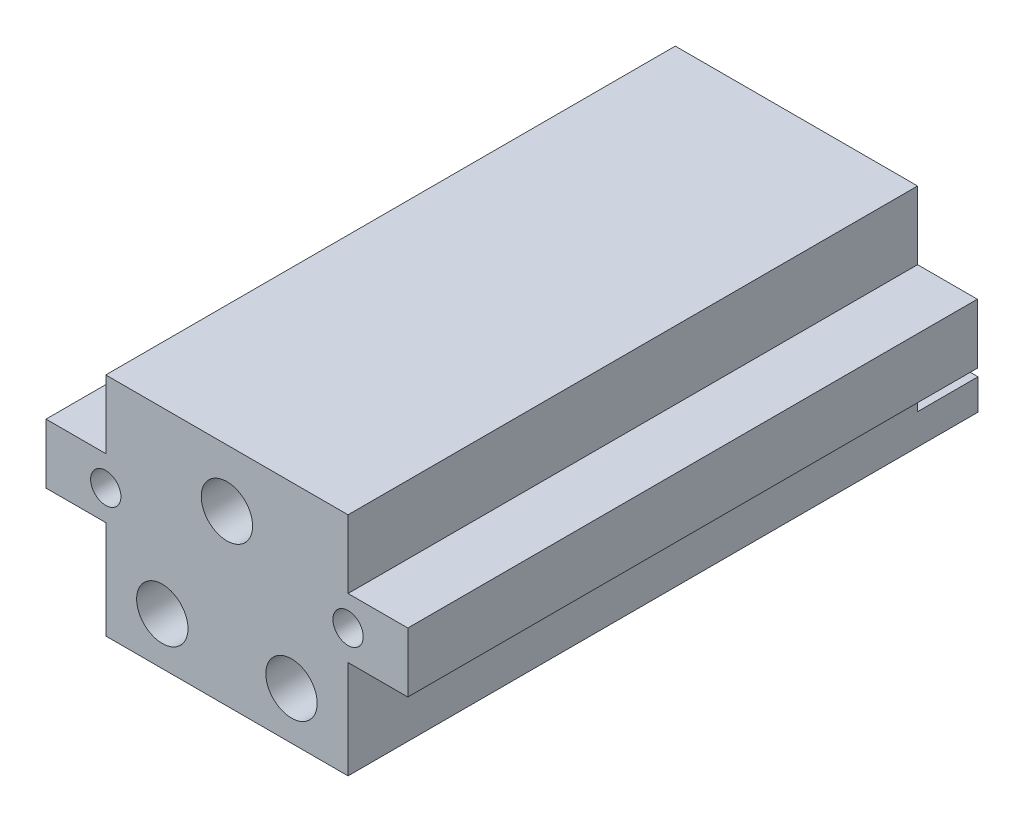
from build123d import *

# Parameters (mm, degrees)
EXTRUDE1_DEPTH                      = 24.765
EXTRUDE1_DEPTH_BACK                 = 24.765
SKETCH2_W                           = 28.448
SKETCH2_H                           = 4.7498
CUT_EXTRUDE1_DEPTH                  = 15.367
F_1_4_28_TAPPED_HOLE1_D             = 5.4102
F_1_4_28_TAPPED_HOLE1_DEPTH         = 6.35
F_1_4_28_TAPPED_HOLE1_TIP           = 1.625388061
F_1_4_0_25_DIAMETER_HOLE1_D         = 6.35
F_1_4_0_25_DIAMETER_HOLE1_DEPTH     = 6.35
F_1_4_0_25_DIAMETER_HOLE1_TIP       = 1.907732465
F_3_32_0_09375_DIAMETER_HOLE1_D     = 2.38252
F_3_32_0_09375_DIAMETER_HOLE1_DEPTH = 6.35
F_3_32_0_09375_DIAMETER_HOLE1_TIP   = 0.715781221
F_10_32_TAPPED_HOLE1_D              = 4.0386
F_10_32_TAPPED_HOLE1_DEPTH          = 12.7
F_10_32_TAPPED_HOLE1_TIP            = 1.213317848


with BuildPart() as part:
    # Sketch1 → Extrude1 (new, two sides: drawn at the far end of the back side and taken through both)
    with BuildSketch(Plane.XY.offset(-EXTRUDE1_DEPTH_BACK)):
        Polygon((-9.525, 7.7089), (9.525, 7.7089), (9.525, 2.3495), (14.224, 2.3495), (14.224, -2.3495), (9.525, -2.3495), (9.525, -10.0711), (-9.525, -10.0711), (-9.525, -2.3495), (-14.224, -2.3495), (-14.224, 2.3495), (-9.525, 2.3495), align=None)
    extrude(amount=EXTRUDE1_DEPTH + EXTRUDE1_DEPTH_BACK)

    # Sketch2 → Cut-Extrude1 (cut)
    with BuildSketch(Plane.XZ.offset(-7.7089)):
        with Locations((0, -22.3901)):
            Rectangle(SKETCH2_W, SKETCH2_H)
    extrude(amount=CUT_EXTRUDE1_DEPTH, mode=Mode.SUBTRACT)

    # 1_4-28 Tapped Hole1
    with Locations(Plane(origin=(-1.262053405, -10.0711, -20.411973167), x_dir=(-1, 0, 0), z_dir=(0, -1, 0))):
        with Locations((-1.262053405, -39.614373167), (-1.262053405, -18.989573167)):
            Hole(F_1_4_28_TAPPED_HOLE1_D / 2, depth=F_1_4_28_TAPPED_HOLE1_DEPTH)
            with Locations((0, 0, -(F_1_4_28_TAPPED_HOLE1_DEPTH + F_1_4_28_TAPPED_HOLE1_TIP / 2))):  # 118° drill point
                Cone(0, F_1_4_28_TAPPED_HOLE1_D / 2, F_1_4_28_TAPPED_HOLE1_TIP, mode=Mode.SUBTRACT)

    # 1_4 _0.25_ Diameter Hole1
    with Locations(Plane(origin=(1.056679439, -10.0711, -26.544837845), x_dir=(-1, 0, 0), z_dir=(0, -1, 0))):
        with Locations((1.056679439, -35.434837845)):
            Hole(F_1_4_0_25_DIAMETER_HOLE1_D / 2, depth=F_1_4_0_25_DIAMETER_HOLE1_DEPTH)
            with Locations((0, 0, -(F_1_4_0_25_DIAMETER_HOLE1_DEPTH + F_1_4_0_25_DIAMETER_HOLE1_TIP / 2))):  # 118° drill point
                Cone(0, F_1_4_0_25_DIAMETER_HOLE1_D / 2, F_1_4_0_25_DIAMETER_HOLE1_TIP, mode=Mode.SUBTRACT)

    # 3_32 _0.09375_ Diameter Hole1
    with Locations(Plane.XY.offset(24.765)):
        with Locations((-9.525, 0.0127), (9.525, 0)):
            Hole(F_3_32_0_09375_DIAMETER_HOLE1_D / 2, depth=F_3_32_0_09375_DIAMETER_HOLE1_DEPTH)
            with Locations((0, 0, -(F_3_32_0_09375_DIAMETER_HOLE1_DEPTH + F_3_32_0_09375_DIAMETER_HOLE1_TIP / 2))):  # 118° drill point
                Cone(0, F_3_32_0_09375_DIAMETER_HOLE1_D / 2, F_3_32_0_09375_DIAMETER_HOLE1_TIP, mode=Mode.SUBTRACT)

    # 10-32 Tapped Hole1
    with Locations(Plane.XY.offset(24.765)):
        with Locations((-5.08, -6.3373), (5.08, -6.3373), (0, 3.1877)):
            Hole(F_10_32_TAPPED_HOLE1_D / 2, depth=F_10_32_TAPPED_HOLE1_DEPTH)
            with Locations((0, 0, -(F_10_32_TAPPED_HOLE1_DEPTH + F_10_32_TAPPED_HOLE1_TIP / 2))):  # 118° drill point
                Cone(0, F_10_32_TAPPED_HOLE1_D / 2, F_10_32_TAPPED_HOLE1_TIP, mode=Mode.SUBTRACT)


solid = part.part
